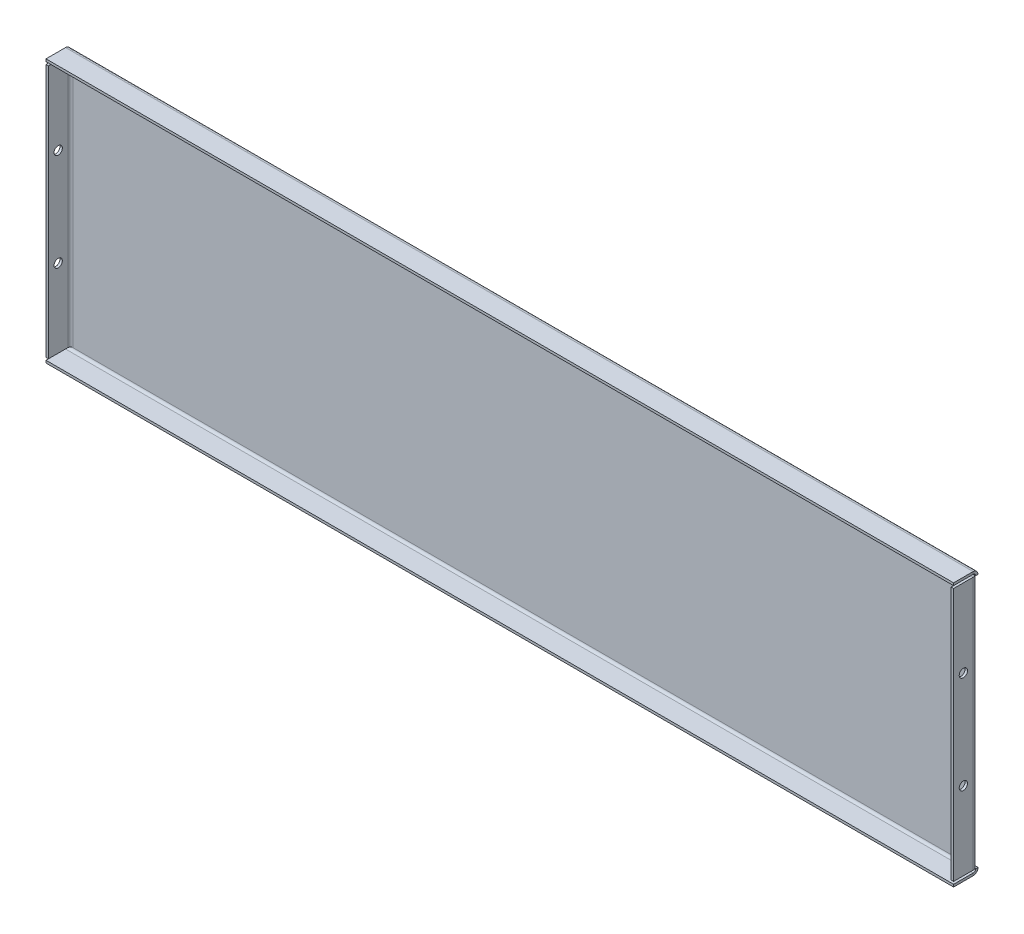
ISO-10303-21;
HEADER;
FILE_DESCRIPTION(('STEP AP214'),'2;1');
FILE_NAME('part.step','',(''),(''),'','','');
FILE_SCHEMA(('AUTOMOTIVE_DESIGN { 1 0 10303 214 1 1 1 1 }'));
ENDSEC;
DATA;
#1=APPLICATION_CONTEXT('core data for automotive mechanical design processes');
#2=APPLICATION_PROTOCOL_DEFINITION('international standard','automotive_design',2000,#1);
#3=PRODUCT_CONTEXT('',#1,'mechanical');
#4=PRODUCT('Part','Part','',(#3));
#5=PRODUCT_RELATED_PRODUCT_CATEGORY('part','',(#4));
#6=PRODUCT_DEFINITION_FORMATION('','',#4);
#7=PRODUCT_DEFINITION_CONTEXT('part definition',#1,'design');
#8=PRODUCT_DEFINITION('design','',#6,#7);
#9=PRODUCT_DEFINITION_SHAPE('','',#8);
#10=(LENGTH_UNIT() NAMED_UNIT(*) SI_UNIT(.MILLI.,.METRE.));
#11=(NAMED_UNIT(*) PLANE_ANGLE_UNIT() SI_UNIT($,.RADIAN.));
#12=(NAMED_UNIT(*) SI_UNIT($,.STERADIAN.) SOLID_ANGLE_UNIT());
#13=UNCERTAINTY_MEASURE_WITH_UNIT(LENGTH_MEASURE(1.E-05),#10,'distance_accuracy_value','');
#14=(GEOMETRIC_REPRESENTATION_CONTEXT(3) GLOBAL_UNCERTAINTY_ASSIGNED_CONTEXT((#13)) GLOBAL_UNIT_ASSIGNED_CONTEXT((#10,
#11,#12)) REPRESENTATION_CONTEXT('',''));
#15=CARTESIAN_POINT('',(0.,0.,0.));
#16=DIRECTION('',(0.,0.,1.));
#17=DIRECTION('',(1.,0.,0.));
#18=AXIS2_PLACEMENT_3D('',#15,#16,#17);
#19=CARTESIAN_POINT('',(-465.,5.,-22.5));
#20=DIRECTION('',(0.,1.,0.));
#21=DIRECTION('',(0.,0.,1.));
#22=AXIS2_PLACEMENT_3D('',#19,#20,#21);
#23=PLANE('',#22);
#24=DIRECTION('',(1.,0.,0.));
#25=VECTOR('',#24,1.);
#26=CARTESIAN_POINT('',(-465.,5.,-22.5));
#27=LINE('',#26,#25);
#28=CARTESIAN_POINT('',(-465.,5.,-22.5));
#29=VERTEX_POINT('',#28);
#30=CARTESIAN_POINT('',(-464.330127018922,5.,-22.5));
#31=VERTEX_POINT('',#30);
#32=EDGE_CURVE('E338',#29,#31,#27,.T.);
#33=ORIENTED_EDGE('',*,*,#32,.T.);
#34=CARTESIAN_POINT('',(-460.,5.00000000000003,-20.));
#35=DIRECTION('',(0.,-1.,0.));
#36=DIRECTION('',(0.,0.,-1.));
#37=AXIS2_PLACEMENT_3D('',#34,#35,#36);
#38=CIRCLE('',#37,5.);
#39=CARTESIAN_POINT('',(-460.,5.00000000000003,-25.));
#40=VERTEX_POINT('',#39);
#41=EDGE_CURVE('E13',#31,#40,#38,.T.);
#42=ORIENTED_EDGE('',*,*,#41,.T.);
#43=DIRECTION('',(-1.,0.,0.));
#44=VECTOR('',#43,1.);
#45=CARTESIAN_POINT('',(465.,5.00000000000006,-25.));
#46=LINE('',#45,#44);
#47=CARTESIAN_POINT('',(-465.,5.00000000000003,-25.));
#48=VERTEX_POINT('',#47);
#49=EDGE_CURVE('E500',#40,#48,#46,.T.);
#50=ORIENTED_EDGE('',*,*,#49,.T.);
#51=DIRECTION('',(0.,0.,1.));
#52=VECTOR('',#51,1.);
#53=CARTESIAN_POINT('',(-465.,5.,-25.));
#54=LINE('',#53,#52);
#55=EDGE_CURVE('E557',#48,#29,#54,.T.);
#56=ORIENTED_EDGE('',*,*,#55,.T.);
#57=EDGE_LOOP('',(#33,#42,#50,#56));
#58=FACE_BOUND('',#57,.T.);
#59=ADVANCED_FACE('F80',(#58),#23,.T.);
#60=CARTESIAN_POINT('',(-460.,265.,-22.5));
#61=DIRECTION('',(0.,-1.,0.));
#62=DIRECTION('',(0.,0.,-1.));
#63=AXIS2_PLACEMENT_3D('',#60,#61,#62);
#64=PLANE('',#63);
#65=DIRECTION('',(-1.,0.,0.));
#66=VECTOR('',#65,1.);
#67=CARTESIAN_POINT('',(465.,265.,-25.));
#68=LINE('',#67,#66);
#69=CARTESIAN_POINT('',(-460.,265.,-25.));
#70=VERTEX_POINT('',#69);
#71=CARTESIAN_POINT('',(-465.,265.,-25.));
#72=VERTEX_POINT('',#71);
#73=EDGE_CURVE('E495',#70,#72,#68,.T.);
#74=ORIENTED_EDGE('',*,*,#73,.F.);
#75=CARTESIAN_POINT('',(-460.,265.,-20.));
#76=DIRECTION('',(0.,-1.,0.));
#77=DIRECTION('',(0.,0.,-1.));
#78=AXIS2_PLACEMENT_3D('',#75,#76,#77);
#79=CIRCLE('',#78,5.);
#80=CARTESIAN_POINT('',(-464.330127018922,265.,-22.5));
#81=VERTEX_POINT('',#80);
#82=EDGE_CURVE('E331',#70,#81,#79,.F.);
#83=ORIENTED_EDGE('',*,*,#82,.T.);
#84=DIRECTION('',(-1.,0.,0.));
#85=VECTOR('',#84,1.);
#86=CARTESIAN_POINT('',(-460.,265.,-22.5));
#87=LINE('',#86,#85);
#88=CARTESIAN_POINT('',(-465.,265.,-22.5));
#89=VERTEX_POINT('',#88);
#90=EDGE_CURVE('E334',#81,#89,#87,.T.);
#91=ORIENTED_EDGE('',*,*,#90,.T.);
#92=DIRECTION('',(0.,0.,-1.));
#93=VECTOR('',#92,1.);
#94=CARTESIAN_POINT('',(-465.,265.,-22.5));
#95=LINE('',#94,#93);
#96=EDGE_CURVE('E543',#89,#72,#95,.T.);
#97=ORIENTED_EDGE('',*,*,#96,.T.);
#98=EDGE_LOOP('',(#74,#83,#91,#97));
#99=FACE_BOUND('',#98,.T.);
#100=ADVANCED_FACE('F610',(#99),#64,.T.);
#101=CARTESIAN_POINT('',(465.,0.,-22.5));
#102=DIRECTION('',(0.,0.,1.));
#103=DIRECTION('',(1.,0.,0.));
#104=AXIS2_PLACEMENT_3D('',#101,#102,#103);
#105=PLANE('',#104);
#106=DIRECTION('',(-1.,0.,0.));
#107=VECTOR('',#106,1.);
#108=CARTESIAN_POINT('',(465.,265.,-22.5));
#109=LINE('',#108,#107);
#110=CARTESIAN_POINT('',(460.,265.,-22.5));
#111=VERTEX_POINT('',#110);
#112=CARTESIAN_POINT('',(-460.,265.,-22.5));
#113=VERTEX_POINT('',#112);
#114=EDGE_CURVE('E526',#111,#113,#109,.T.);
#115=ORIENTED_EDGE('',*,*,#114,.T.);
#116=DIRECTION('',(0.,-1.,0.));
#117=VECTOR('',#116,1.);
#118=CARTESIAN_POINT('',(-460.,5.00000000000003,-22.5));
#119=LINE('',#118,#117);
#120=CARTESIAN_POINT('',(-460.,5.00000000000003,-22.5));
#121=VERTEX_POINT('',#120);
#122=EDGE_CURVE('E319',#121,#113,#119,.F.);
#123=ORIENTED_EDGE('',*,*,#122,.F.);
#124=DIRECTION('',(-1.,0.,0.));
#125=VECTOR('',#124,1.);
#126=CARTESIAN_POINT('',(465.,5.00000000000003,-22.5));
#127=LINE('',#126,#125);
#128=CARTESIAN_POINT('',(460.,5.00000000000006,-22.5));
#129=VERTEX_POINT('',#128);
#130=EDGE_CURVE('E521',#129,#121,#127,.T.);
#131=ORIENTED_EDGE('',*,*,#130,.F.);
#132=DIRECTION('',(0.,1.,0.));
#133=VECTOR('',#132,1.);
#134=CARTESIAN_POINT('',(460.,265.,-22.5));
#135=LINE('',#134,#133);
#136=EDGE_CURVE('E394',#111,#129,#135,.F.);
#137=ORIENTED_EDGE('',*,*,#136,.F.);
#138=EDGE_LOOP('',(#115,#123,#131,#137));
#139=FACE_BOUND('',#138,.T.);
#140=ADVANCED_FACE('F616',(#139),#105,.T.);
#141=CARTESIAN_POINT('',(465.,0.,-25.));
#142=DIRECTION('',(0.,0.,1.));
#143=DIRECTION('',(1.,0.,0.));
#144=AXIS2_PLACEMENT_3D('',#141,#142,#143);
#145=PLANE('',#144);
#146=DIRECTION('',(0.,-1.,0.));
#147=VECTOR('',#146,1.);
#148=CARTESIAN_POINT('',(-460.,5.00000000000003,-25.));
#149=LINE('',#148,#147);
#150=EDGE_CURVE('E326',#40,#70,#149,.F.);
#151=ORIENTED_EDGE('',*,*,#150,.T.);
#152=CARTESIAN_POINT('',(460.,265.,-25.0000000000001));
#153=VERTEX_POINT('',#152);
#154=EDGE_CURVE('E501',#153,#70,#68,.T.);
#155=ORIENTED_EDGE('',*,*,#154,.F.);
#156=DIRECTION('',(0.,1.,0.));
#157=VECTOR('',#156,1.);
#158=CARTESIAN_POINT('',(460.,265.,-25.0000000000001));
#159=LINE('',#158,#157);
#160=CARTESIAN_POINT('',(460.,5.00000000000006,-25.0000000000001));
#161=VERTEX_POINT('',#160);
#162=EDGE_CURVE('E401',#153,#161,#159,.F.);
#163=ORIENTED_EDGE('',*,*,#162,.T.);
#164=EDGE_CURVE('E507',#161,#40,#46,.T.);
#165=ORIENTED_EDGE('',*,*,#164,.T.);
#166=EDGE_LOOP('',(#151,#155,#163,#165));
#167=FACE_BOUND('',#166,.T.);
#168=ADVANCED_FACE('F666',(#167),#145,.F.);
#169=CARTESIAN_POINT('',(465.,265.,-22.5));
#170=DIRECTION('',(0.,-1.,0.));
#171=DIRECTION('',(0.,0.,-1.));
#172=AXIS2_PLACEMENT_3D('',#169,#170,#171);
#173=PLANE('',#172);
#174=CARTESIAN_POINT('',(465.,265.,-22.5));
#175=VERTEX_POINT('',#174);
#176=CARTESIAN_POINT('',(464.330127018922,265.,-22.5));
#177=VERTEX_POINT('',#176);
#178=EDGE_CURVE('E528',#175,#177,#109,.T.);
#179=ORIENTED_EDGE('',*,*,#178,.T.);
#180=CARTESIAN_POINT('',(460.,265.,-20.));
#181=DIRECTION('',(0.,1.,0.));
#182=DIRECTION('',(0.,0.,1.));
#183=AXIS2_PLACEMENT_3D('',#180,#181,#182);
#184=CIRCLE('',#183,5.);
#185=EDGE_CURVE('E90',#177,#153,#184,.T.);
#186=ORIENTED_EDGE('',*,*,#185,.T.);
#187=CARTESIAN_POINT('',(465.,265.,-25.));
#188=VERTEX_POINT('',#187);
#189=EDGE_CURVE('E496',#188,#153,#68,.T.);
#190=ORIENTED_EDGE('',*,*,#189,.F.);
#191=DIRECTION('',(0.,0.,1.));
#192=VECTOR('',#191,1.);
#193=CARTESIAN_POINT('',(465.,265.,-25.));
#194=LINE('',#193,#192);
#195=EDGE_CURVE('E551',#188,#175,#194,.T.);
#196=ORIENTED_EDGE('',*,*,#195,.T.);
#197=EDGE_LOOP('',(#179,#186,#190,#196));
#198=FACE_BOUND('',#197,.T.);
#199=ADVANCED_FACE('F662',(#198),#173,.T.);
#200=CARTESIAN_POINT('',(460.,5.00000000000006,-22.5));
#201=DIRECTION('',(0.,1.,0.));
#202=DIRECTION('',(0.,0.,1.));
#203=AXIS2_PLACEMENT_3D('',#200,#201,#202);
#204=PLANE('',#203);
#205=CARTESIAN_POINT('',(465.,5.00000000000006,-25.));
#206=VERTEX_POINT('',#205);
#207=EDGE_CURVE('E502',#206,#161,#46,.T.);
#208=ORIENTED_EDGE('',*,*,#207,.T.);
#209=CARTESIAN_POINT('',(460.,5.00000000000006,-20.));
#210=DIRECTION('',(0.,1.,0.));
#211=DIRECTION('',(0.,0.,1.));
#212=AXIS2_PLACEMENT_3D('',#209,#210,#211);
#213=CIRCLE('',#212,5.);
#214=CARTESIAN_POINT('',(464.330127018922,5.00000000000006,-22.5));
#215=VERTEX_POINT('',#214);
#216=EDGE_CURVE('E406',#161,#215,#213,.F.);
#217=ORIENTED_EDGE('',*,*,#216,.T.);
#218=CARTESIAN_POINT('',(465.,5.00000000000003,-22.5));
#219=VERTEX_POINT('',#218);
#220=EDGE_CURVE('E522',#219,#215,#127,.T.);
#221=ORIENTED_EDGE('',*,*,#220,.F.);
#222=DIRECTION('',(0.,0.,-1.));
#223=VECTOR('',#222,1.);
#224=CARTESIAN_POINT('',(465.,5.00000000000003,-22.5));
#225=LINE('',#224,#223);
#226=EDGE_CURVE('E560',#219,#206,#225,.T.);
#227=ORIENTED_EDGE('',*,*,#226,.T.);
#228=EDGE_LOOP('',(#208,#217,#221,#227));
#229=FACE_BOUND('',#228,.T.);
#230=ADVANCED_FACE('F659',(#229),#204,.T.);
#231=CARTESIAN_POINT('',(465.,0.,-20.));
#232=DIRECTION('',(1.,0.,0.));
#233=DIRECTION('',(0.,0.,-1.));
#234=AXIS2_PLACEMENT_3D('',#231,#232,#233);
#235=PLANE('',#234);
#236=DIRECTION('',(0.,1.,0.));
#237=VECTOR('',#236,1.);
#238=CARTESIAN_POINT('',(465.,0.,-20.));
#239=LINE('',#238,#237);
#240=CARTESIAN_POINT('',(465.,0.,-20.));
#241=VERTEX_POINT('',#240);
#242=CARTESIAN_POINT('',(465.,2.50000000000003,-20.));
#243=VERTEX_POINT('',#242);
#244=EDGE_CURVE('E563',#241,#243,#239,.T.);
#245=ORIENTED_EDGE('',*,*,#244,.F.);
#246=CARTESIAN_POINT('',(465.,5.00000000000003,-20.));
#247=DIRECTION('',(-1.,0.,0.));
#248=DIRECTION('',(0.,0.,1.));
#249=AXIS2_PLACEMENT_3D('',#246,#247,#248);
#250=CIRCLE('',#249,5.);
#251=EDGE_CURVE('E484',#241,#206,#250,.F.);
#252=ORIENTED_EDGE('',*,*,#251,.T.);
#253=ORIENTED_EDGE('',*,*,#226,.F.);
#254=CARTESIAN_POINT('',(465.,5.00000000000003,-20.));
#255=DIRECTION('',(1.,0.,0.));
#256=DIRECTION('',(0.,0.,-1.));
#257=AXIS2_PLACEMENT_3D('',#254,#255,#256);
#258=CIRCLE('',#257,2.5);
#259=EDGE_CURVE('E468',#243,#219,#258,.T.);
#260=ORIENTED_EDGE('',*,*,#259,.F.);
#261=EDGE_LOOP('',(#245,#252,#253,#260));
#262=FACE_BOUND('',#261,.T.);
#263=ADVANCED_FACE('F82',(#262),#235,.T.);
#264=CARTESIAN_POINT('',(465.,5.00000000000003,-22.5));
#265=DIRECTION('',(1.,0.,0.));
#266=DIRECTION('',(0.,0.,-1.));
#267=AXIS2_PLACEMENT_3D('',#264,#265,#266);
#268=PLANE('',#267);
#269=DIRECTION('',(0.,0.,-1.));
#270=VECTOR('',#269,1.);
#271=CARTESIAN_POINT('',(465.,0.,0.));
#272=LINE('',#271,#270);
#273=CARTESIAN_POINT('',(465.,0.,0.));
#274=VERTEX_POINT('',#273);
#275=EDGE_CURVE('E480',#274,#241,#272,.T.);
#276=ORIENTED_EDGE('',*,*,#275,.T.);
#277=ORIENTED_EDGE('',*,*,#244,.T.);
#278=DIRECTION('',(0.,0.,-1.));
#279=VECTOR('',#278,1.);
#280=CARTESIAN_POINT('',(465.,2.50000000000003,0.));
#281=LINE('',#280,#279);
#282=CARTESIAN_POINT('',(465.,2.50000000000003,0.));
#283=VERTEX_POINT('',#282);
#284=EDGE_CURVE('E472',#283,#243,#281,.T.);
#285=ORIENTED_EDGE('',*,*,#284,.F.);
#286=DIRECTION('',(0.,1.,0.));
#287=VECTOR('',#286,1.);
#288=CARTESIAN_POINT('',(465.,0.,0.));
#289=LINE('',#288,#287);
#290=EDGE_CURVE('E476',#274,#283,#289,.T.);
#291=ORIENTED_EDGE('',*,*,#290,.F.);
#292=EDGE_LOOP('',(#276,#277,#285,#291));
#293=FACE_BOUND('',#292,.T.);
#294=ADVANCED_FACE('F733',(#293),#268,.T.);
#295=CARTESIAN_POINT('',(-465.,5.,-25.));
#296=DIRECTION('',(-1.,0.,0.));
#297=DIRECTION('',(0.,0.,1.));
#298=AXIS2_PLACEMENT_3D('',#295,#296,#297);
#299=PLANE('',#298);
#300=ORIENTED_EDGE('',*,*,#55,.F.);
#301=CARTESIAN_POINT('',(-465.,5.,-20.));
#302=DIRECTION('',(-1.,0.,0.));
#303=DIRECTION('',(0.,0.,1.));
#304=AXIS2_PLACEMENT_3D('',#301,#302,#303);
#305=CIRCLE('',#304,5.);
#306=CARTESIAN_POINT('',(-465.,0.,-20.));
#307=VERTEX_POINT('',#306);
#308=EDGE_CURVE('E445',#307,#48,#305,.F.);
#309=ORIENTED_EDGE('',*,*,#308,.F.);
#310=DIRECTION('',(0.,-1.,0.));
#311=VECTOR('',#310,1.);
#312=CARTESIAN_POINT('',(-465.,2.50000000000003,-20.));
#313=LINE('',#312,#311);
#314=CARTESIAN_POINT('',(-465.,2.50000000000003,-20.));
#315=VERTEX_POINT('',#314);
#316=EDGE_CURVE('E554',#315,#307,#313,.T.);
#317=ORIENTED_EDGE('',*,*,#316,.F.);
#318=CARTESIAN_POINT('',(-465.,5.,-20.));
#319=DIRECTION('',(1.,0.,0.));
#320=DIRECTION('',(0.,0.,-1.));
#321=AXIS2_PLACEMENT_3D('',#318,#319,#320);
#322=CIRCLE('',#321,2.5);
#323=EDGE_CURVE('E429',#315,#29,#322,.T.);
#324=ORIENTED_EDGE('',*,*,#323,.T.);
#325=EDGE_LOOP('',(#300,#309,#317,#324));
#326=FACE_BOUND('',#325,.T.);
#327=ADVANCED_FACE('F730',(#326),#299,.T.);
#328=CARTESIAN_POINT('',(465.,265.,-25.));
#329=DIRECTION('',(1.,0.,0.));
#330=DIRECTION('',(0.,0.,-1.));
#331=AXIS2_PLACEMENT_3D('',#328,#329,#330);
#332=PLANE('',#331);
#333=ORIENTED_EDGE('',*,*,#195,.F.);
#334=CARTESIAN_POINT('',(465.,265.,-20.));
#335=DIRECTION('',(-1.,0.,0.));
#336=DIRECTION('',(0.,0.,1.));
#337=AXIS2_PLACEMENT_3D('',#334,#335,#336);
#338=CIRCLE('',#337,5.);
#339=CARTESIAN_POINT('',(465.,270.,-20.));
#340=VERTEX_POINT('',#339);
#341=EDGE_CURVE('E488',#188,#340,#338,.F.);
#342=ORIENTED_EDGE('',*,*,#341,.T.);
#343=DIRECTION('',(0.,1.,0.));
#344=VECTOR('',#343,1.);
#345=CARTESIAN_POINT('',(465.,267.5,-20.));
#346=LINE('',#345,#344);
#347=CARTESIAN_POINT('',(465.,267.5,-20.));
#348=VERTEX_POINT('',#347);
#349=EDGE_CURVE('E107',#348,#340,#346,.T.);
#350=ORIENTED_EDGE('',*,*,#349,.F.);
#351=CARTESIAN_POINT('',(465.,265.,-20.));
#352=DIRECTION('',(1.,0.,0.));
#353=DIRECTION('',(0.,0.,-1.));
#354=AXIS2_PLACEMENT_3D('',#351,#352,#353);
#355=CIRCLE('',#354,2.5);
#356=EDGE_CURVE('E464',#175,#348,#355,.T.);
#357=ORIENTED_EDGE('',*,*,#356,.F.);
#358=EDGE_LOOP('',(#333,#342,#350,#357));
#359=FACE_BOUND('',#358,.T.);
#360=ADVANCED_FACE('F726',(#359),#332,.T.);
#361=CARTESIAN_POINT('',(-465.,270.,-20.));
#362=DIRECTION('',(-1.,0.,0.));
#363=DIRECTION('',(0.,0.,1.));
#364=AXIS2_PLACEMENT_3D('',#361,#362,#363);
#365=PLANE('',#364);
#366=DIRECTION('',(0.,-1.,0.));
#367=VECTOR('',#366,1.);
#368=CARTESIAN_POINT('',(-465.,270.,-20.));
#369=LINE('',#368,#367);
#370=CARTESIAN_POINT('',(-465.,270.,-20.));
#371=VERTEX_POINT('',#370);
#372=CARTESIAN_POINT('',(-465.,267.5,-20.));
#373=VERTEX_POINT('',#372);
#374=EDGE_CURVE('E546',#371,#373,#369,.T.);
#375=ORIENTED_EDGE('',*,*,#374,.F.);
#376=CARTESIAN_POINT('',(-465.,265.,-20.));
#377=DIRECTION('',(-1.,0.,0.));
#378=DIRECTION('',(0.,0.,1.));
#379=AXIS2_PLACEMENT_3D('',#376,#377,#378);
#380=CIRCLE('',#379,5.);
#381=EDGE_CURVE('E449',#72,#371,#380,.F.);
#382=ORIENTED_EDGE('',*,*,#381,.F.);
#383=ORIENTED_EDGE('',*,*,#96,.F.);
#384=CARTESIAN_POINT('',(-465.,265.,-20.));
#385=DIRECTION('',(1.,0.,0.));
#386=DIRECTION('',(0.,0.,-1.));
#387=AXIS2_PLACEMENT_3D('',#384,#385,#386);
#388=CIRCLE('',#387,2.5);
#389=EDGE_CURVE('E425',#89,#373,#388,.T.);
#390=ORIENTED_EDGE('',*,*,#389,.T.);
#391=EDGE_LOOP('',(#375,#382,#383,#390));
#392=FACE_BOUND('',#391,.T.);
#393=ADVANCED_FACE('F722',(#392),#365,.T.);
#394=CARTESIAN_POINT('',(-465.,265.,-22.5));
#395=DIRECTION('',(-1.,0.,0.));
#396=DIRECTION('',(0.,0.,1.));
#397=AXIS2_PLACEMENT_3D('',#394,#395,#396);
#398=PLANE('',#397);
#399=DIRECTION('',(0.,0.,1.));
#400=VECTOR('',#399,1.);
#401=CARTESIAN_POINT('',(-465.,270.,-25.));
#402=LINE('',#401,#400);
#403=CARTESIAN_POINT('',(-465.,270.,0.));
#404=VERTEX_POINT('',#403);
#405=EDGE_CURVE('E410',#371,#404,#402,.T.);
#406=ORIENTED_EDGE('',*,*,#405,.F.);
#407=ORIENTED_EDGE('',*,*,#374,.T.);
#408=DIRECTION('',(0.,0.,-1.));
#409=VECTOR('',#408,1.);
#410=CARTESIAN_POINT('',(-465.,267.5,-25.));
#411=LINE('',#410,#409);
#412=CARTESIAN_POINT('',(-465.,267.5,0.));
#413=VERTEX_POINT('',#412);
#414=EDGE_CURVE('E421',#373,#413,#411,.F.);
#415=ORIENTED_EDGE('',*,*,#414,.T.);
#416=DIRECTION('',(0.,1.,0.));
#417=VECTOR('',#416,1.);
#418=CARTESIAN_POINT('',(-465.,267.5,0.));
#419=LINE('',#418,#417);
#420=EDGE_CURVE('E417',#413,#404,#419,.T.);
#421=ORIENTED_EDGE('',*,*,#420,.T.);
#422=EDGE_LOOP('',(#406,#407,#415,#421));
#423=FACE_BOUND('',#422,.T.);
#424=ADVANCED_FACE('F718',(#423),#398,.T.);
#425=CARTESIAN_POINT('',(465.,270.,-25.));
#426=DIRECTION('',(0.,-1.,0.));
#427=DIRECTION('',(0.,0.,-1.));
#428=AXIS2_PLACEMENT_3D('',#425,#426,#427);
#429=PLANE('',#428);
#430=ORIENTED_EDGE('',*,*,#405,.T.);
#431=DIRECTION('',(-1.,0.,0.));
#432=VECTOR('',#431,1.);
#433=CARTESIAN_POINT('',(465.,270.,0.));
#434=LINE('',#433,#432);
#435=CARTESIAN_POINT('',(465.,270.,0.));
#436=VERTEX_POINT('',#435);
#437=EDGE_CURVE('E540',#436,#404,#434,.T.);
#438=ORIENTED_EDGE('',*,*,#437,.F.);
#439=DIRECTION('',(0.,0.,1.));
#440=VECTOR('',#439,1.);
#441=CARTESIAN_POINT('',(465.,270.,-25.));
#442=LINE('',#441,#440);
#443=EDGE_CURVE('E453',#340,#436,#442,.T.);
#444=ORIENTED_EDGE('',*,*,#443,.F.);
#445=DIRECTION('',(-1.,0.,0.));
#446=VECTOR('',#445,1.);
#447=CARTESIAN_POINT('',(465.,270.,-20.));
#448=LINE('',#447,#446);
#449=EDGE_CURVE('E491',#340,#371,#448,.T.);
#450=ORIENTED_EDGE('',*,*,#449,.T.);
#451=EDGE_LOOP('',(#430,#438,#444,#450));
#452=FACE_BOUND('',#451,.T.);
#453=ADVANCED_FACE('F714',(#452),#429,.F.);
#454=CARTESIAN_POINT('',(465.,267.5,0.));
#455=DIRECTION('',(0.,0.,1.));
#456=DIRECTION('',(1.,0.,0.));
#457=AXIS2_PLACEMENT_3D('',#454,#455,#456);
#458=PLANE('',#457);
#459=ORIENTED_EDGE('',*,*,#420,.F.);
#460=DIRECTION('',(-1.,0.,0.));
#461=VECTOR('',#460,1.);
#462=CARTESIAN_POINT('',(465.,267.5,0.));
#463=LINE('',#462,#461);
#464=CARTESIAN_POINT('',(465.,267.5,0.));
#465=VERTEX_POINT('',#464);
#466=EDGE_CURVE('E537',#465,#413,#463,.T.);
#467=ORIENTED_EDGE('',*,*,#466,.F.);
#468=DIRECTION('',(0.,1.,0.));
#469=VECTOR('',#468,1.);
#470=CARTESIAN_POINT('',(465.,267.5,0.));
#471=LINE('',#470,#469);
#472=EDGE_CURVE('E456',#465,#436,#471,.T.);
#473=ORIENTED_EDGE('',*,*,#472,.T.);
#474=ORIENTED_EDGE('',*,*,#437,.T.);
#475=EDGE_LOOP('',(#459,#467,#473,#474));
#476=FACE_BOUND('',#475,.T.);
#477=ADVANCED_FACE('F710',(#476),#458,.T.);
#478=CARTESIAN_POINT('',(465.,267.5,-25.));
#479=DIRECTION('',(0.,-1.,0.));
#480=DIRECTION('',(0.,0.,-1.));
#481=AXIS2_PLACEMENT_3D('',#478,#479,#480);
#482=PLANE('',#481);
#483=ORIENTED_EDGE('',*,*,#414,.F.);
#484=DIRECTION('',(-1.,0.,0.));
#485=VECTOR('',#484,1.);
#486=CARTESIAN_POINT('',(465.,267.5,-20.));
#487=LINE('',#486,#485);
#488=EDGE_CURVE('E532',#348,#373,#487,.T.);
#489=ORIENTED_EDGE('',*,*,#488,.F.);
#490=DIRECTION('',(0.,0.,-1.));
#491=VECTOR('',#490,1.);
#492=CARTESIAN_POINT('',(465.,267.5,-25.));
#493=LINE('',#492,#491);
#494=EDGE_CURVE('E460',#348,#465,#493,.F.);
#495=ORIENTED_EDGE('',*,*,#494,.T.);
#496=ORIENTED_EDGE('',*,*,#466,.T.);
#497=EDGE_LOOP('',(#483,#489,#495,#496));
#498=FACE_BOUND('',#497,.T.);
#499=ADVANCED_FACE('F706',(#498),#482,.T.);
#500=CARTESIAN_POINT('',(465.,265.,-20.));
#501=DIRECTION('',(-1.,0.,0.));
#502=DIRECTION('',(0.,0.,1.));
#503=AXIS2_PLACEMENT_3D('',#500,#501,#502);
#504=CYLINDRICAL_SURFACE('',#503,2.5);
#505=ORIENTED_EDGE('',*,*,#389,.F.);
#506=ORIENTED_EDGE('',*,*,#90,.F.);
#507=EDGE_CURVE('E342',#113,#81,#87,.T.);
#508=ORIENTED_EDGE('',*,*,#507,.F.);
#509=ORIENTED_EDGE('',*,*,#114,.F.);
#510=EDGE_CURVE('E533',#177,#111,#109,.T.);
#511=ORIENTED_EDGE('',*,*,#510,.F.);
#512=ORIENTED_EDGE('',*,*,#178,.F.);
#513=ORIENTED_EDGE('',*,*,#356,.T.);
#514=ORIENTED_EDGE('',*,*,#488,.T.);
#515=EDGE_LOOP('',(#505,#506,#508,#509,#511,#512,#513,#514));
#516=FACE_BOUND('',#515,.T.);
#517=ADVANCED_FACE('F700',(#516),#504,.F.);
#518=CARTESIAN_POINT('',(465.,5.00000000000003,-20.));
#519=DIRECTION('',(-1.,0.,0.));
#520=DIRECTION('',(0.,0.,1.));
#521=AXIS2_PLACEMENT_3D('',#518,#519,#520);
#522=CYLINDRICAL_SURFACE('',#521,2.5);
#523=ORIENTED_EDGE('',*,*,#323,.F.);
#524=DIRECTION('',(-1.,0.,0.));
#525=VECTOR('',#524,1.);
#526=CARTESIAN_POINT('',(465.,2.50000000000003,-20.));
#527=LINE('',#526,#525);
#528=EDGE_CURVE('E517',#243,#315,#527,.T.);
#529=ORIENTED_EDGE('',*,*,#528,.F.);
#530=ORIENTED_EDGE('',*,*,#259,.T.);
#531=ORIENTED_EDGE('',*,*,#220,.T.);
#532=EDGE_CURVE('E527',#215,#129,#127,.T.);
#533=ORIENTED_EDGE('',*,*,#532,.T.);
#534=ORIENTED_EDGE('',*,*,#130,.T.);
#535=EDGE_CURVE('E99',#31,#121,#27,.T.);
#536=ORIENTED_EDGE('',*,*,#535,.F.);
#537=ORIENTED_EDGE('',*,*,#32,.F.);
#538=EDGE_LOOP('',(#523,#529,#530,#531,#533,#534,#536,#537));
#539=FACE_BOUND('',#538,.T.);
#540=ADVANCED_FACE('F696',(#539),#522,.F.);
#541=CARTESIAN_POINT('',(465.,2.50000000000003,0.));
#542=DIRECTION('',(0.,1.,0.));
#543=DIRECTION('',(0.,0.,1.));
#544=AXIS2_PLACEMENT_3D('',#541,#542,#543);
#545=PLANE('',#544);
#546=DIRECTION('',(0.,0.,-1.));
#547=VECTOR('',#546,1.);
#548=CARTESIAN_POINT('',(-465.,2.5,0.));
#549=LINE('',#548,#547);
#550=CARTESIAN_POINT('',(-465.,2.5,0.));
#551=VERTEX_POINT('',#550);
#552=EDGE_CURVE('E433',#551,#315,#549,.T.);
#553=ORIENTED_EDGE('',*,*,#552,.F.);
#554=DIRECTION('',(-1.,0.,0.));
#555=VECTOR('',#554,1.);
#556=CARTESIAN_POINT('',(465.,2.50000000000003,0.));
#557=LINE('',#556,#555);
#558=EDGE_CURVE('E514',#283,#551,#557,.T.);
#559=ORIENTED_EDGE('',*,*,#558,.F.);
#560=ORIENTED_EDGE('',*,*,#284,.T.);
#561=ORIENTED_EDGE('',*,*,#528,.T.);
#562=EDGE_LOOP('',(#553,#559,#560,#561));
#563=FACE_BOUND('',#562,.T.);
#564=ADVANCED_FACE('F692',(#563),#545,.T.);
#565=CARTESIAN_POINT('',(465.,0.,0.));
#566=DIRECTION('',(0.,0.,1.));
#567=DIRECTION('',(1.,0.,0.));
#568=AXIS2_PLACEMENT_3D('',#565,#566,#567);
#569=PLANE('',#568);
#570=DIRECTION('',(0.,1.,0.));
#571=VECTOR('',#570,1.);
#572=CARTESIAN_POINT('',(-465.,0.,0.));
#573=LINE('',#572,#571);
#574=CARTESIAN_POINT('',(-465.,0.,0.));
#575=VERTEX_POINT('',#574);
#576=EDGE_CURVE('E437',#575,#551,#573,.T.);
#577=ORIENTED_EDGE('',*,*,#576,.F.);
#578=DIRECTION('',(-1.,0.,0.));
#579=VECTOR('',#578,1.);
#580=CARTESIAN_POINT('',(465.,0.,0.));
#581=LINE('',#580,#579);
#582=EDGE_CURVE('E511',#274,#575,#581,.T.);
#583=ORIENTED_EDGE('',*,*,#582,.F.);
#584=ORIENTED_EDGE('',*,*,#290,.T.);
#585=ORIENTED_EDGE('',*,*,#558,.T.);
#586=EDGE_LOOP('',(#577,#583,#584,#585));
#587=FACE_BOUND('',#586,.T.);
#588=ADVANCED_FACE('F688',(#587),#569,.T.);
#589=CARTESIAN_POINT('',(465.,0.,0.));
#590=DIRECTION('',(0.,1.,0.));
#591=DIRECTION('',(0.,0.,1.));
#592=AXIS2_PLACEMENT_3D('',#589,#590,#591);
#593=PLANE('',#592);
#594=DIRECTION('',(0.,0.,-1.));
#595=VECTOR('',#594,1.);
#596=CARTESIAN_POINT('',(-465.,0.,0.));
#597=LINE('',#596,#595);
#598=EDGE_CURVE('E441',#575,#307,#597,.T.);
#599=ORIENTED_EDGE('',*,*,#598,.T.);
#600=DIRECTION('',(-1.,0.,0.));
#601=VECTOR('',#600,1.);
#602=CARTESIAN_POINT('',(465.,0.,-20.));
#603=LINE('',#602,#601);
#604=EDGE_CURVE('E506',#241,#307,#603,.T.);
#605=ORIENTED_EDGE('',*,*,#604,.F.);
#606=ORIENTED_EDGE('',*,*,#275,.F.);
#607=ORIENTED_EDGE('',*,*,#582,.T.);
#608=EDGE_LOOP('',(#599,#605,#606,#607));
#609=FACE_BOUND('',#608,.T.);
#610=ADVANCED_FACE('F684',(#609),#593,.F.);
#611=CARTESIAN_POINT('',(465.,5.00000000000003,-20.));
#612=DIRECTION('',(-1.,0.,0.));
#613=DIRECTION('',(0.,0.,1.));
#614=AXIS2_PLACEMENT_3D('',#611,#612,#613);
#615=CYLINDRICAL_SURFACE('',#614,5.);
#616=ORIENTED_EDGE('',*,*,#308,.T.);
#617=ORIENTED_EDGE('',*,*,#49,.F.);
#618=ORIENTED_EDGE('',*,*,#164,.F.);
#619=ORIENTED_EDGE('',*,*,#207,.F.);
#620=ORIENTED_EDGE('',*,*,#251,.F.);
#621=ORIENTED_EDGE('',*,*,#604,.T.);
#622=EDGE_LOOP('',(#616,#617,#618,#619,#620,#621));
#623=FACE_BOUND('',#622,.T.);
#624=ADVANCED_FACE('F677',(#623),#615,.T.);
#625=CARTESIAN_POINT('',(465.,265.,-20.));
#626=DIRECTION('',(-1.,0.,0.));
#627=DIRECTION('',(0.,0.,1.));
#628=AXIS2_PLACEMENT_3D('',#625,#626,#627);
#629=CYLINDRICAL_SURFACE('',#628,5.);
#630=ORIENTED_EDGE('',*,*,#381,.T.);
#631=ORIENTED_EDGE('',*,*,#449,.F.);
#632=ORIENTED_EDGE('',*,*,#341,.F.);
#633=ORIENTED_EDGE('',*,*,#189,.T.);
#634=ORIENTED_EDGE('',*,*,#154,.T.);
#635=ORIENTED_EDGE('',*,*,#73,.T.);
#636=EDGE_LOOP('',(#630,#631,#632,#633,#634,#635));
#637=FACE_BOUND('',#636,.T.);
#638=ADVANCED_FACE('F674',(#637),#629,.T.);
#639=CARTESIAN_POINT('',(465.,265.,-20.));
#640=DIRECTION('',(1.,0.,0.));
#641=DIRECTION('',(0.,0.,-1.));
#642=AXIS2_PLACEMENT_3D('',#639,#640,#641);
#643=PLANE('',#642);
#644=ORIENTED_EDGE('',*,*,#443,.T.);
#645=ORIENTED_EDGE('',*,*,#472,.F.);
#646=ORIENTED_EDGE('',*,*,#494,.F.);
#647=ORIENTED_EDGE('',*,*,#349,.T.);
#648=EDGE_LOOP('',(#644,#645,#646,#647));
#649=FACE_BOUND('',#648,.T.);
#650=ADVANCED_FACE('F670',(#649),#643,.T.);
#651=CARTESIAN_POINT('',(-465.,265.,-20.));
#652=DIRECTION('',(1.,0.,0.));
#653=DIRECTION('',(0.,0.,-1.));
#654=AXIS2_PLACEMENT_3D('',#651,#652,#653);
#655=PLANE('',#654);
#656=ORIENTED_EDGE('',*,*,#552,.T.);
#657=ORIENTED_EDGE('',*,*,#316,.T.);
#658=ORIENTED_EDGE('',*,*,#598,.F.);
#659=ORIENTED_EDGE('',*,*,#576,.T.);
#660=EDGE_LOOP('',(#656,#657,#658,#659));
#661=FACE_BOUND('',#660,.T.);
#662=ADVANCED_FACE('F654',(#661),#655,.F.);
#663=CARTESIAN_POINT('',(460.,5.00000000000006,-20.));
#664=DIRECTION('',(0.,-1.,0.));
#665=DIRECTION('',(0.,0.,-1.));
#666=AXIS2_PLACEMENT_3D('',#663,#664,#665);
#667=PLANE('',#666);
#668=ORIENTED_EDGE('',*,*,#532,.F.);
#669=CARTESIAN_POINT('',(465.,5.00000000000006,-20.));
#670=VERTEX_POINT('',#669);
#671=EDGE_CURVE('E405',#215,#670,#213,.F.);
#672=ORIENTED_EDGE('',*,*,#671,.T.);
#673=DIRECTION('',(-1.,0.,0.));
#674=VECTOR('',#673,1.);
#675=CARTESIAN_POINT('',(465.,5.00000000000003,-20.));
#676=LINE('',#675,#674);
#677=CARTESIAN_POINT('',(462.5,5.00000000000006,-20.));
#678=VERTEX_POINT('',#677);
#679=EDGE_CURVE('E341',#678,#670,#676,.F.);
#680=ORIENTED_EDGE('',*,*,#679,.F.);
#681=CARTESIAN_POINT('',(460.,5.00000000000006,-20.));
#682=DIRECTION('',(0.,1.,0.));
#683=DIRECTION('',(0.,0.,1.));
#684=AXIS2_PLACEMENT_3D('',#681,#682,#683);
#685=CIRCLE('',#684,2.5);
#686=EDGE_CURVE('E389',#129,#678,#685,.F.);
#687=ORIENTED_EDGE('',*,*,#686,.F.);
#688=EDGE_LOOP('',(#668,#672,#680,#687));
#689=FACE_BOUND('',#688,.T.);
#690=ADVANCED_FACE('F651',(#689),#667,.T.);
#691=CARTESIAN_POINT('',(460.,265.,-20.));
#692=DIRECTION('',(0.,-1.,0.));
#693=DIRECTION('',(0.,0.,-1.));
#694=AXIS2_PLACEMENT_3D('',#691,#692,#693);
#695=PLANE('',#694);
#696=CARTESIAN_POINT('',(465.,265.,-20.));
#697=VERTEX_POINT('',#696);
#698=EDGE_CURVE('E393',#697,#177,#184,.T.);
#699=ORIENTED_EDGE('',*,*,#698,.T.);
#700=ORIENTED_EDGE('',*,*,#510,.T.);
#701=CARTESIAN_POINT('',(460.,265.,-20.));
#702=DIRECTION('',(0.,1.,0.));
#703=DIRECTION('',(0.,0.,1.));
#704=AXIS2_PLACEMENT_3D('',#701,#702,#703);
#705=CIRCLE('',#704,2.5);
#706=CARTESIAN_POINT('',(462.5,265.,-20.));
#707=VERTEX_POINT('',#706);
#708=EDGE_CURVE('E350',#707,#111,#705,.T.);
#709=ORIENTED_EDGE('',*,*,#708,.F.);
#710=DIRECTION('',(-1.,0.,0.));
#711=VECTOR('',#710,1.);
#712=CARTESIAN_POINT('',(462.5,265.,-20.));
#713=LINE('',#712,#711);
#714=EDGE_CURVE('E379',#707,#697,#713,.F.);
#715=ORIENTED_EDGE('',*,*,#714,.T.);
#716=EDGE_LOOP('',(#699,#700,#709,#715));
#717=FACE_BOUND('',#716,.T.);
#718=ADVANCED_FACE('F647',(#717),#695,.F.);
#719=CARTESIAN_POINT('',(460.,265.,-20.));
#720=DIRECTION('',(0.,1.,0.));
#721=DIRECTION('',(1.,0.,0.));
#722=AXIS2_PLACEMENT_3D('',#719,#720,#721);
#723=CYLINDRICAL_SURFACE('',#722,5.);
#724=ORIENTED_EDGE('',*,*,#162,.F.);
#725=ORIENTED_EDGE('',*,*,#185,.F.);
#726=ORIENTED_EDGE('',*,*,#698,.F.);
#727=DIRECTION('',(0.,1.,0.));
#728=VECTOR('',#727,1.);
#729=CARTESIAN_POINT('',(465.,5.00000000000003,-20.));
#730=LINE('',#729,#728);
#731=EDGE_CURVE('E375',#697,#670,#730,.F.);
#732=ORIENTED_EDGE('',*,*,#731,.T.);
#733=ORIENTED_EDGE('',*,*,#671,.F.);
#734=ORIENTED_EDGE('',*,*,#216,.F.);
#735=EDGE_LOOP('',(#724,#725,#726,#732,#733,#734));
#736=FACE_BOUND('',#735,.T.);
#737=ADVANCED_FACE('F645',(#736),#723,.T.);
#738=CARTESIAN_POINT('',(460.,265.,-20.));
#739=DIRECTION('',(0.,1.,0.));
#740=DIRECTION('',(1.,0.,0.));
#741=AXIS2_PLACEMENT_3D('',#738,#739,#740);
#742=CYLINDRICAL_SURFACE('',#741,2.5);
#743=ORIENTED_EDGE('',*,*,#136,.T.);
#744=ORIENTED_EDGE('',*,*,#686,.T.);
#745=DIRECTION('',(0.,1.,0.));
#746=VECTOR('',#745,1.);
#747=CARTESIAN_POINT('',(462.5,5.00000000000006,-20.));
#748=LINE('',#747,#746);
#749=EDGE_CURVE('E383',#678,#707,#748,.T.);
#750=ORIENTED_EDGE('',*,*,#749,.T.);
#751=ORIENTED_EDGE('',*,*,#708,.T.);
#752=EDGE_LOOP('',(#743,#744,#750,#751));
#753=FACE_BOUND('',#752,.T.);
#754=ADVANCED_FACE('F641',(#753),#742,.F.);
#755=CARTESIAN_POINT('',(465.,265.,0.));
#756=DIRECTION('',(0.,-1.,0.));
#757=DIRECTION('',(1.,0.,0.));
#758=AXIS2_PLACEMENT_3D('',#755,#756,#757);
#759=PLANE('',#758);
#760=ORIENTED_EDGE('',*,*,#714,.F.);
#761=DIRECTION('',(0.,0.,-1.));
#762=VECTOR('',#761,1.);
#763=CARTESIAN_POINT('',(462.5,265.,0.));
#764=LINE('',#763,#762);
#765=CARTESIAN_POINT('',(462.5,265.,0.));
#766=VERTEX_POINT('',#765);
#767=EDGE_CURVE('E372',#707,#766,#764,.F.);
#768=ORIENTED_EDGE('',*,*,#767,.T.);
#769=DIRECTION('',(-1.,0.,0.));
#770=VECTOR('',#769,1.);
#771=CARTESIAN_POINT('',(465.,265.,0.));
#772=LINE('',#771,#770);
#773=CARTESIAN_POINT('',(465.,265.,0.));
#774=VERTEX_POINT('',#773);
#775=EDGE_CURVE('E346',#774,#766,#772,.T.);
#776=ORIENTED_EDGE('',*,*,#775,.F.);
#777=DIRECTION('',(0.,0.,1.));
#778=VECTOR('',#777,1.);
#779=CARTESIAN_POINT('',(465.,265.,-22.5));
#780=LINE('',#779,#778);
#781=EDGE_CURVE('E362',#697,#774,#780,.T.);
#782=ORIENTED_EDGE('',*,*,#781,.F.);
#783=EDGE_LOOP('',(#760,#768,#776,#782));
#784=FACE_BOUND('',#783,.T.);
#785=ADVANCED_FACE('F633',(#784),#759,.F.);
#786=CARTESIAN_POINT('',(465.,5.00000000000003,-22.5));
#787=DIRECTION('',(0.,1.,0.));
#788=DIRECTION('',(-1.,0.,0.));
#789=AXIS2_PLACEMENT_3D('',#786,#787,#788);
#790=PLANE('',#789);
#791=ORIENTED_EDGE('',*,*,#679,.T.);
#792=DIRECTION('',(0.,0.,-1.));
#793=VECTOR('',#792,1.);
#794=CARTESIAN_POINT('',(465.,5.00000000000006,-22.5));
#795=LINE('',#794,#793);
#796=CARTESIAN_POINT('',(465.,5.00000000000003,0.));
#797=VERTEX_POINT('',#796);
#798=EDGE_CURVE('E355',#797,#670,#795,.T.);
#799=ORIENTED_EDGE('',*,*,#798,.F.);
#800=DIRECTION('',(-1.,0.,0.));
#801=VECTOR('',#800,1.);
#802=CARTESIAN_POINT('',(465.,5.00000000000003,0.));
#803=LINE('',#802,#801);
#804=CARTESIAN_POINT('',(462.5,5.00000000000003,0.));
#805=VERTEX_POINT('',#804);
#806=EDGE_CURVE('E351',#797,#805,#803,.T.);
#807=ORIENTED_EDGE('',*,*,#806,.T.);
#808=DIRECTION('',(0.,0.,1.));
#809=VECTOR('',#808,1.);
#810=CARTESIAN_POINT('',(462.5,5.00000000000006,-22.5));
#811=LINE('',#810,#809);
#812=EDGE_CURVE('E365',#805,#678,#811,.F.);
#813=ORIENTED_EDGE('',*,*,#812,.T.);
#814=EDGE_LOOP('',(#791,#799,#807,#813));
#815=FACE_BOUND('',#814,.T.);
#816=ADVANCED_FACE('F629',(#815),#790,.F.);
#817=CARTESIAN_POINT('',(465.,265.,-22.5));
#818=DIRECTION('',(-1.,0.,0.));
#819=DIRECTION('',(0.,0.,1.));
#820=AXIS2_PLACEMENT_3D('',#817,#818,#819);
#821=PLANE('',#820);
#822=CARTESIAN_POINT('',(465.,185.,-10.));
#823=DIRECTION('',(1.,0.,0.));
#824=DIRECTION('',(0.,0.,-1.));
#825=AXIS2_PLACEMENT_3D('',#822,#823,#824);
#826=CIRCLE('',#825,4.24999999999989);
#827=CARTESIAN_POINT('',(465.,185.,-14.2499999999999));
#828=VERTEX_POINT('',#827);
#829=EDGE_CURVE('E803',#828,#828,#826,.T.);
#830=ORIENTED_EDGE('',*,*,#829,.F.);
#831=EDGE_LOOP('',(#830));
#832=FACE_BOUND('',#831,.T.);
#833=CARTESIAN_POINT('',(465.,85.0000000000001,-10.));
#834=DIRECTION('',(1.,0.,0.));
#835=DIRECTION('',(0.,0.,-1.));
#836=AXIS2_PLACEMENT_3D('',#833,#834,#835);
#837=CIRCLE('',#836,4.24999999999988);
#838=CARTESIAN_POINT('',(465.,85.0000000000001,-14.2499999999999));
#839=VERTEX_POINT('',#838);
#840=EDGE_CURVE('E568',#839,#839,#837,.T.);
#841=ORIENTED_EDGE('',*,*,#840,.F.);
#842=EDGE_LOOP('',(#841));
#843=FACE_BOUND('',#842,.T.);
#844=ORIENTED_EDGE('',*,*,#731,.F.);
#845=ORIENTED_EDGE('',*,*,#781,.T.);
#846=DIRECTION('',(0.,-1.,0.));
#847=VECTOR('',#846,1.);
#848=CARTESIAN_POINT('',(465.,265.,0.));
#849=LINE('',#848,#847);
#850=EDGE_CURVE('E359',#774,#797,#849,.T.);
#851=ORIENTED_EDGE('',*,*,#850,.T.);
#852=ORIENTED_EDGE('',*,*,#798,.T.);
#853=EDGE_LOOP('',(#844,#845,#851,#852));
#854=FACE_BOUND('',#853,.T.);
#855=ADVANCED_FACE('F625',(#832,#843,#854),#821,.F.);
#856=CARTESIAN_POINT('',(462.5,265.,-22.5));
#857=DIRECTION('',(-1.,0.,0.));
#858=DIRECTION('',(0.,0.,1.));
#859=AXIS2_PLACEMENT_3D('',#856,#857,#858);
#860=PLANE('',#859);
#861=CARTESIAN_POINT('',(462.5,185.,-10.));
#862=DIRECTION('',(-1.,0.,0.));
#863=DIRECTION('',(0.,0.,1.));
#864=AXIS2_PLACEMENT_3D('',#861,#862,#863);
#865=CIRCLE('',#864,4.24999999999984);
#866=CARTESIAN_POINT('',(462.5,185.,-5.75000000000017));
#867=VERTEX_POINT('',#866);
#868=EDGE_CURVE('E583',#867,#867,#865,.T.);
#869=ORIENTED_EDGE('',*,*,#868,.F.);
#870=EDGE_LOOP('',(#869));
#871=FACE_BOUND('',#870,.T.);
#872=CARTESIAN_POINT('',(462.5,85.0000000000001,-10.));
#873=DIRECTION('',(-1.,0.,0.));
#874=DIRECTION('',(0.,0.,1.));
#875=AXIS2_PLACEMENT_3D('',#872,#873,#874);
#876=CIRCLE('',#875,4.24999999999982);
#877=CARTESIAN_POINT('',(462.5,85.0000000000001,-5.75000000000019));
#878=VERTEX_POINT('',#877);
#879=EDGE_CURVE('E314',#878,#878,#876,.T.);
#880=ORIENTED_EDGE('',*,*,#879,.F.);
#881=EDGE_LOOP('',(#880));
#882=FACE_BOUND('',#881,.T.);
#883=ORIENTED_EDGE('',*,*,#767,.F.);
#884=ORIENTED_EDGE('',*,*,#749,.F.);
#885=ORIENTED_EDGE('',*,*,#812,.F.);
#886=DIRECTION('',(0.,1.,0.));
#887=VECTOR('',#886,1.);
#888=CARTESIAN_POINT('',(462.5,5.00000000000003,0.));
#889=LINE('',#888,#887);
#890=EDGE_CURVE('E369',#766,#805,#889,.F.);
#891=ORIENTED_EDGE('',*,*,#890,.F.);
#892=EDGE_LOOP('',(#883,#884,#885,#891));
#893=FACE_BOUND('',#892,.T.);
#894=ADVANCED_FACE('F621',(#871,#882,#893),#860,.T.);
#895=CARTESIAN_POINT('',(465.,5.00000000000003,0.));
#896=DIRECTION('',(0.,0.,-1.));
#897=DIRECTION('',(-1.,0.,0.));
#898=AXIS2_PLACEMENT_3D('',#895,#896,#897);
#899=PLANE('',#898);
#900=ORIENTED_EDGE('',*,*,#890,.T.);
#901=ORIENTED_EDGE('',*,*,#806,.F.);
#902=ORIENTED_EDGE('',*,*,#850,.F.);
#903=ORIENTED_EDGE('',*,*,#775,.T.);
#904=EDGE_LOOP('',(#900,#901,#902,#903));
#905=FACE_BOUND('',#904,.T.);
#906=ADVANCED_FACE('F624',(#905),#899,.F.);
#907=CARTESIAN_POINT('',(-460.,265.,-20.));
#908=DIRECTION('',(0.,1.,0.));
#909=DIRECTION('',(0.,0.,1.));
#910=AXIS2_PLACEMENT_3D('',#907,#908,#909);
#911=PLANE('',#910);
#912=CARTESIAN_POINT('',(-460.,265.,-20.));
#913=DIRECTION('',(0.,-1.,0.));
#914=DIRECTION('',(0.,0.,-1.));
#915=AXIS2_PLACEMENT_3D('',#912,#913,#914);
#916=CIRCLE('',#915,2.5);
#917=CARTESIAN_POINT('',(-462.5,265.,-20.));
#918=VERTEX_POINT('',#917);
#919=EDGE_CURVE('E315',#113,#918,#916,.F.);
#920=ORIENTED_EDGE('',*,*,#919,.F.);
#921=ORIENTED_EDGE('',*,*,#507,.T.);
#922=CARTESIAN_POINT('',(-465.,265.,-20.0000000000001));
#923=VERTEX_POINT('',#922);
#924=EDGE_CURVE('E330',#81,#923,#79,.F.);
#925=ORIENTED_EDGE('',*,*,#924,.T.);
#926=DIRECTION('',(1.,0.,0.));
#927=VECTOR('',#926,1.);
#928=CARTESIAN_POINT('',(-465.,265.,-20.0000000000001));
#929=LINE('',#928,#927);
#930=EDGE_CURVE('E284',#918,#923,#929,.F.);
#931=ORIENTED_EDGE('',*,*,#930,.F.);
#932=EDGE_LOOP('',(#920,#921,#925,#931));
#933=FACE_BOUND('',#932,.T.);
#934=ADVANCED_FACE('F637',(#933),#911,.T.);
#935=CARTESIAN_POINT('',(-460.,5.00000000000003,-20.));
#936=DIRECTION('',(0.,1.,0.));
#937=DIRECTION('',(0.,0.,1.));
#938=AXIS2_PLACEMENT_3D('',#935,#936,#937);
#939=PLANE('',#938);
#940=CARTESIAN_POINT('',(-465.,5.00000000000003,-20.));
#941=VERTEX_POINT('',#940);
#942=EDGE_CURVE('E92',#941,#31,#38,.T.);
#943=ORIENTED_EDGE('',*,*,#942,.T.);
#944=ORIENTED_EDGE('',*,*,#535,.T.);
#945=CARTESIAN_POINT('',(-460.,5.00000000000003,-20.));
#946=DIRECTION('',(0.,-1.,0.));
#947=DIRECTION('',(0.,0.,-1.));
#948=AXIS2_PLACEMENT_3D('',#945,#946,#947);
#949=CIRCLE('',#948,2.5);
#950=CARTESIAN_POINT('',(-462.5,5.00000000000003,-20.));
#951=VERTEX_POINT('',#950);
#952=EDGE_CURVE('E322',#951,#121,#949,.T.);
#953=ORIENTED_EDGE('',*,*,#952,.F.);
#954=DIRECTION('',(1.,0.,0.));
#955=VECTOR('',#954,1.);
#956=CARTESIAN_POINT('',(-462.5,5.00000000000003,-20.));
#957=LINE('',#956,#955);
#958=EDGE_CURVE('E305',#951,#941,#957,.F.);
#959=ORIENTED_EDGE('',*,*,#958,.T.);
#960=EDGE_LOOP('',(#943,#944,#953,#959));
#961=FACE_BOUND('',#960,.T.);
#962=ADVANCED_FACE('F597',(#961),#939,.F.);
#963=CARTESIAN_POINT('',(-460.,5.00000000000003,-20.));
#964=DIRECTION('',(0.,-1.,0.));
#965=DIRECTION('',(-1.,0.,0.));
#966=AXIS2_PLACEMENT_3D('',#963,#964,#965);
#967=CYLINDRICAL_SURFACE('',#966,5.);
#968=ORIENTED_EDGE('',*,*,#150,.F.);
#969=ORIENTED_EDGE('',*,*,#41,.F.);
#970=ORIENTED_EDGE('',*,*,#942,.F.);
#971=DIRECTION('',(0.,-1.,0.));
#972=VECTOR('',#971,1.);
#973=CARTESIAN_POINT('',(-465.,265.,-20.0000000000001));
#974=LINE('',#973,#972);
#975=EDGE_CURVE('E301',#941,#923,#974,.F.);
#976=ORIENTED_EDGE('',*,*,#975,.T.);
#977=ORIENTED_EDGE('',*,*,#924,.F.);
#978=ORIENTED_EDGE('',*,*,#82,.F.);
#979=EDGE_LOOP('',(#968,#969,#970,#976,#977,#978));
#980=FACE_BOUND('',#979,.T.);
#981=ADVANCED_FACE('F606',(#980),#967,.T.);
#982=CARTESIAN_POINT('',(-460.,5.00000000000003,-20.));
#983=DIRECTION('',(0.,-1.,0.));
#984=DIRECTION('',(-1.,0.,0.));
#985=AXIS2_PLACEMENT_3D('',#982,#983,#984);
#986=CYLINDRICAL_SURFACE('',#985,2.5);
#987=ORIENTED_EDGE('',*,*,#122,.T.);
#988=ORIENTED_EDGE('',*,*,#919,.T.);
#989=DIRECTION('',(0.,-1.,0.));
#990=VECTOR('',#989,1.);
#991=CARTESIAN_POINT('',(-462.5,265.,-20.));
#992=LINE('',#991,#990);
#993=EDGE_CURVE('E309',#918,#951,#992,.T.);
#994=ORIENTED_EDGE('',*,*,#993,.T.);
#995=ORIENTED_EDGE('',*,*,#952,.T.);
#996=EDGE_LOOP('',(#987,#988,#994,#995));
#997=FACE_BOUND('',#996,.T.);
#998=ADVANCED_FACE('F593',(#997),#986,.F.);
#999=CARTESIAN_POINT('',(-465.,5.,0.));
#1000=DIRECTION('',(0.,1.,0.));
#1001=DIRECTION('',(0.,0.,1.));
#1002=AXIS2_PLACEMENT_3D('',#999,#1000,#1001);
#1003=PLANE('',#1002);
#1004=ORIENTED_EDGE('',*,*,#958,.F.);
#1005=DIRECTION('',(0.,0.,-1.));
#1006=VECTOR('',#1005,1.);
#1007=CARTESIAN_POINT('',(-462.5,5.,0.));
#1008=LINE('',#1007,#1006);
#1009=CARTESIAN_POINT('',(-462.5,5.,0.));
#1010=VERTEX_POINT('',#1009);
#1011=EDGE_CURVE('E298',#951,#1010,#1008,.F.);
#1012=ORIENTED_EDGE('',*,*,#1011,.T.);
#1013=DIRECTION('',(1.,0.,0.));
#1014=VECTOR('',#1013,1.);
#1015=CARTESIAN_POINT('',(-465.,5.00000000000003,0.));
#1016=LINE('',#1015,#1014);
#1017=CARTESIAN_POINT('',(-465.,5.00000000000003,0.));
#1018=VERTEX_POINT('',#1017);
#1019=EDGE_CURVE('E280',#1018,#1010,#1016,.T.);
#1020=ORIENTED_EDGE('',*,*,#1019,.F.);
#1021=DIRECTION('',(0.,0.,1.));
#1022=VECTOR('',#1021,1.);
#1023=CARTESIAN_POINT('',(-465.,5.00000000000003,-22.5000000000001));
#1024=LINE('',#1023,#1022);
#1025=EDGE_CURVE('E265',#941,#1018,#1024,.T.);
#1026=ORIENTED_EDGE('',*,*,#1025,.F.);
#1027=EDGE_LOOP('',(#1004,#1012,#1020,#1026));
#1028=FACE_BOUND('',#1027,.T.);
#1029=ADVANCED_FACE('F598',(#1028),#1003,.F.);
#1030=CARTESIAN_POINT('',(-465.,265.,-22.5));
#1031=DIRECTION('',(0.,-1.,0.));
#1032=DIRECTION('',(1.,0.,0.));
#1033=AXIS2_PLACEMENT_3D('',#1030,#1031,#1032);
#1034=PLANE('',#1033);
#1035=ORIENTED_EDGE('',*,*,#930,.T.);
#1036=DIRECTION('',(0.,0.,-1.));
#1037=VECTOR('',#1036,1.);
#1038=CARTESIAN_POINT('',(-465.,265.,-22.5));
#1039=LINE('',#1038,#1037);
#1040=CARTESIAN_POINT('',(-465.,265.,0.));
#1041=VERTEX_POINT('',#1040);
#1042=EDGE_CURVE('E263',#1041,#923,#1039,.T.);
#1043=ORIENTED_EDGE('',*,*,#1042,.F.);
#1044=DIRECTION('',(1.,0.,0.));
#1045=VECTOR('',#1044,1.);
#1046=CARTESIAN_POINT('',(-465.,265.,0.));
#1047=LINE('',#1046,#1045);
#1048=CARTESIAN_POINT('',(-462.5,265.,0.));
#1049=VERTEX_POINT('',#1048);
#1050=EDGE_CURVE('E272',#1041,#1049,#1047,.T.);
#1051=ORIENTED_EDGE('',*,*,#1050,.T.);
#1052=DIRECTION('',(0.,0.,1.));
#1053=VECTOR('',#1052,1.);
#1054=CARTESIAN_POINT('',(-462.5,265.,-22.5));
#1055=LINE('',#1054,#1053);
#1056=EDGE_CURVE('E293',#1049,#918,#1055,.F.);
#1057=ORIENTED_EDGE('',*,*,#1056,.T.);
#1058=EDGE_LOOP('',(#1035,#1043,#1051,#1057));
#1059=FACE_BOUND('',#1058,.T.);
#1060=ADVANCED_FACE('F283',(#1059),#1034,.F.);
#1061=CARTESIAN_POINT('',(-465.,265.,-22.5));
#1062=DIRECTION('',(1.,0.,0.));
#1063=DIRECTION('',(0.,0.,-1.));
#1064=AXIS2_PLACEMENT_3D('',#1061,#1062,#1063);
#1065=PLANE('',#1064);
#1066=CARTESIAN_POINT('',(-465.,185.,-9.99999999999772));
#1067=DIRECTION('',(1.,0.,0.));
#1068=DIRECTION('',(0.,0.,-1.));
#1069=AXIS2_PLACEMENT_3D('',#1066,#1067,#1068);
#1070=CIRCLE('',#1069,4.24999999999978);
#1071=CARTESIAN_POINT('',(-465.,185.,-14.2499999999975));
#1072=VERTEX_POINT('',#1071);
#1073=EDGE_CURVE('E809',#1072,#1072,#1070,.T.);
#1074=ORIENTED_EDGE('',*,*,#1073,.T.);
#1075=EDGE_LOOP('',(#1074));
#1076=FACE_BOUND('',#1075,.T.);
#1077=CARTESIAN_POINT('',(-465.,85.0000000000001,-9.99999999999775));
#1078=DIRECTION('',(1.,0.,0.));
#1079=DIRECTION('',(0.,0.,-1.));
#1080=AXIS2_PLACEMENT_3D('',#1077,#1078,#1079);
#1081=CIRCLE('',#1080,4.24999999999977);
#1082=CARTESIAN_POINT('',(-465.,85.0000000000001,-14.2499999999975));
#1083=VERTEX_POINT('',#1082);
#1084=EDGE_CURVE('E577',#1083,#1083,#1081,.T.);
#1085=ORIENTED_EDGE('',*,*,#1084,.T.);
#1086=EDGE_LOOP('',(#1085));
#1087=FACE_BOUND('',#1086,.T.);
#1088=ORIENTED_EDGE('',*,*,#975,.F.);
#1089=ORIENTED_EDGE('',*,*,#1025,.T.);
#1090=DIRECTION('',(0.,1.,0.));
#1091=VECTOR('',#1090,1.);
#1092=CARTESIAN_POINT('',(-465.,265.,0.));
#1093=LINE('',#1092,#1091);
#1094=EDGE_CURVE('E258',#1018,#1041,#1093,.T.);
#1095=ORIENTED_EDGE('',*,*,#1094,.T.);
#1096=ORIENTED_EDGE('',*,*,#1042,.T.);
#1097=EDGE_LOOP('',(#1088,#1089,#1095,#1096));
#1098=FACE_BOUND('',#1097,.T.);
#1099=ADVANCED_FACE('F261',(#1076,#1087,#1098),#1065,.F.);
#1100=CARTESIAN_POINT('',(-462.5,265.,-22.5));
#1101=DIRECTION('',(1.,0.,0.));
#1102=DIRECTION('',(0.,0.,-1.));
#1103=AXIS2_PLACEMENT_3D('',#1100,#1101,#1102);
#1104=PLANE('',#1103);
#1105=CARTESIAN_POINT('',(-462.5,185.,-9.99999999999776));
#1106=DIRECTION('',(1.,0.,0.));
#1107=DIRECTION('',(0.,0.,-1.));
#1108=AXIS2_PLACEMENT_3D('',#1105,#1106,#1107);
#1109=CIRCLE('',#1108,4.24999999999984);
#1110=CARTESIAN_POINT('',(-462.5,185.,-14.2499999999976));
#1111=VERTEX_POINT('',#1110);
#1112=EDGE_CURVE('E84',#1111,#1111,#1109,.T.);
#1113=ORIENTED_EDGE('',*,*,#1112,.F.);
#1114=EDGE_LOOP('',(#1113));
#1115=FACE_BOUND('',#1114,.T.);
#1116=CARTESIAN_POINT('',(-462.5,85.0000000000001,-9.99999999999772));
#1117=DIRECTION('',(1.,0.,0.));
#1118=DIRECTION('',(0.,0.,-1.));
#1119=AXIS2_PLACEMENT_3D('',#1116,#1117,#1118);
#1120=CIRCLE('',#1119,4.24999999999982);
#1121=CARTESIAN_POINT('',(-462.5,85.0000000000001,-14.2499999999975));
#1122=VERTEX_POINT('',#1121);
#1123=EDGE_CURVE('E565',#1122,#1122,#1120,.T.);
#1124=ORIENTED_EDGE('',*,*,#1123,.F.);
#1125=EDGE_LOOP('',(#1124));
#1126=FACE_BOUND('',#1125,.T.);
#1127=ORIENTED_EDGE('',*,*,#1011,.F.);
#1128=ORIENTED_EDGE('',*,*,#993,.F.);
#1129=ORIENTED_EDGE('',*,*,#1056,.F.);
#1130=DIRECTION('',(0.,-1.,0.));
#1131=VECTOR('',#1130,1.);
#1132=CARTESIAN_POINT('',(-462.5,265.,0.));
#1133=LINE('',#1132,#1131);
#1134=EDGE_CURVE('E275',#1010,#1049,#1133,.F.);
#1135=ORIENTED_EDGE('',*,*,#1134,.F.);
#1136=EDGE_LOOP('',(#1127,#1128,#1129,#1135));
#1137=FACE_BOUND('',#1136,.T.);
#1138=ADVANCED_FACE('F589',(#1115,#1126,#1137),#1104,.T.);
#1139=CARTESIAN_POINT('',(-465.,265.,0.));
#1140=DIRECTION('',(0.,0.,-1.));
#1141=DIRECTION('',(-1.,0.,0.));
#1142=AXIS2_PLACEMENT_3D('',#1139,#1140,#1141);
#1143=PLANE('',#1142);
#1144=ORIENTED_EDGE('',*,*,#1134,.T.);
#1145=ORIENTED_EDGE('',*,*,#1050,.F.);
#1146=ORIENTED_EDGE('',*,*,#1094,.F.);
#1147=ORIENTED_EDGE('',*,*,#1019,.T.);
#1148=EDGE_LOOP('',(#1144,#1145,#1146,#1147));
#1149=FACE_BOUND('',#1148,.T.);
#1150=ADVANCED_FACE('F273',(#1149),#1143,.F.);
#1151=CARTESIAN_POINT('',(465.,85.0000000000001,-10.));
#1152=DIRECTION('',(1.,0.,0.));
#1153=DIRECTION('',(0.,0.,-1.));
#1154=AXIS2_PLACEMENT_3D('',#1151,#1152,#1153);
#1155=CYLINDRICAL_SURFACE('',#1154,4.24999999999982);
#1156=ORIENTED_EDGE('',*,*,#1123,.T.);
#1157=EDGE_LOOP('',(#1156));
#1158=FACE_BOUND('',#1157,.T.);
#1159=ORIENTED_EDGE('',*,*,#1084,.F.);
#1160=EDGE_LOOP('',(#1159));
#1161=FACE_BOUND('',#1160,.T.);
#1162=ADVANCED_FACE('F830',(#1158,#1161),#1155,.F.);
#1163=ORIENTED_EDGE('',*,*,#879,.T.);
#1164=EDGE_LOOP('',(#1163));
#1165=FACE_BOUND('',#1164,.T.);
#1166=ORIENTED_EDGE('',*,*,#840,.T.);
#1167=EDGE_LOOP('',(#1166));
#1168=FACE_BOUND('',#1167,.T.);
#1169=ADVANCED_FACE('F823',(#1165,#1168),#1155,.F.);
#1170=CARTESIAN_POINT('',(465.,185.,-10.));
#1171=DIRECTION('',(1.,0.,0.));
#1172=DIRECTION('',(0.,0.,-1.));
#1173=AXIS2_PLACEMENT_3D('',#1170,#1171,#1172);
#1174=CYLINDRICAL_SURFACE('',#1173,4.24999999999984);
#1175=ORIENTED_EDGE('',*,*,#1112,.T.);
#1176=EDGE_LOOP('',(#1175));
#1177=FACE_BOUND('',#1176,.T.);
#1178=ORIENTED_EDGE('',*,*,#1073,.F.);
#1179=EDGE_LOOP('',(#1178));
#1180=FACE_BOUND('',#1179,.T.);
#1181=ADVANCED_FACE('F820',(#1177,#1180),#1174,.F.);
#1182=ORIENTED_EDGE('',*,*,#868,.T.);
#1183=EDGE_LOOP('',(#1182));
#1184=FACE_BOUND('',#1183,.T.);
#1185=ORIENTED_EDGE('',*,*,#829,.T.);
#1186=EDGE_LOOP('',(#1185));
#1187=FACE_BOUND('',#1186,.T.);
#1188=ADVANCED_FACE('F822',(#1184,#1187),#1174,.F.);
#1189=CLOSED_SHELL('',(#59,#100,#140,#168,#199,#230,#263,#294,#327,#360,#393,#424,#453,#477,
#499,#517,#540,#564,#588,#610,#624,#638,#650,#662,#690,#718,#737,#754,#785,#816,#855,#894,#906,
#934,#962,#981,#998,#1029,#1060,#1099,#1138,#1150,#1162,#1169,#1181,#1188));
#1190=MANIFOLD_SOLID_BREP('B2',#1189);
#1191=ADVANCED_BREP_SHAPE_REPRESENTATION('',(#18,#1190),#14);
#1192=SHAPE_DEFINITION_REPRESENTATION(#9,#1191);
ENDSEC;
END-ISO-10303-21;
